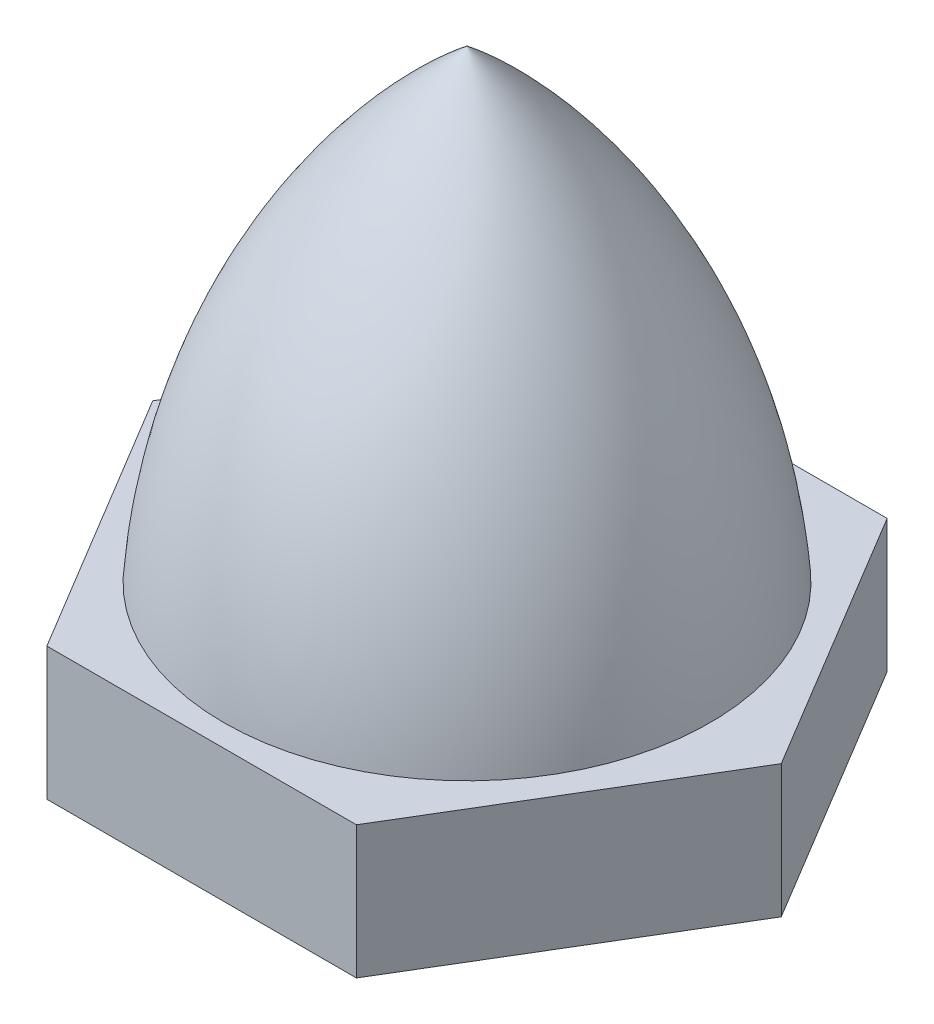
ISO-10303-21;
HEADER;
FILE_DESCRIPTION(('STEP AP214'),'2;1');
FILE_NAME('part.step','',(''),(''),'','','');
FILE_SCHEMA(('AUTOMOTIVE_DESIGN { 1 0 10303 214 1 1 1 1 }'));
ENDSEC;
DATA;
#1=APPLICATION_CONTEXT('core data for automotive mechanical design processes');
#2=APPLICATION_PROTOCOL_DEFINITION('international standard','automotive_design',2000,#1);
#3=PRODUCT_CONTEXT('',#1,'mechanical');
#4=PRODUCT('Part','Part','',(#3));
#5=PRODUCT_RELATED_PRODUCT_CATEGORY('part','',(#4));
#6=PRODUCT_DEFINITION_FORMATION('','',#4);
#7=PRODUCT_DEFINITION_CONTEXT('part definition',#1,'design');
#8=PRODUCT_DEFINITION('design','',#6,#7);
#9=PRODUCT_DEFINITION_SHAPE('','',#8);
#10=(LENGTH_UNIT() NAMED_UNIT(*) SI_UNIT(.MILLI.,.METRE.));
#11=(NAMED_UNIT(*) PLANE_ANGLE_UNIT() SI_UNIT($,.RADIAN.));
#12=(NAMED_UNIT(*) SI_UNIT($,.STERADIAN.) SOLID_ANGLE_UNIT());
#13=UNCERTAINTY_MEASURE_WITH_UNIT(LENGTH_MEASURE(1.E-05),#10,'distance_accuracy_value','');
#14=(GEOMETRIC_REPRESENTATION_CONTEXT(3) GLOBAL_UNCERTAINTY_ASSIGNED_CONTEXT((#13)) GLOBAL_UNIT_ASSIGNED_CONTEXT((#10,
#11,#12)) REPRESENTATION_CONTEXT('',''));
#15=CARTESIAN_POINT('',(0.,0.,0.));
#16=DIRECTION('',(0.,0.,1.));
#17=DIRECTION('',(1.,0.,0.));
#18=AXIS2_PLACEMENT_3D('',#15,#16,#17);
#19=CARTESIAN_POINT('',(-7.10555127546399,0.,0.));
#20=DIRECTION('',(0.,-1.,0.));
#21=DIRECTION('',(0.,0.,-1.));
#22=AXIS2_PLACEMENT_3D('',#19,#20,#21);
#23=PLANE('',#22);
#24=DIRECTION('',(-0.515078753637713,0.,-0.857142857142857));
#25=VECTOR('',#24,1.);
#26=CARTESIAN_POINT('',(-3.5,0.,6.));
#27=LINE('',#26,#25);
#28=CARTESIAN_POINT('',(-3.5,0.,6.));
#29=VERTEX_POINT('',#28);
#30=CARTESIAN_POINT('',(-7.10555127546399,0.,0.));
#31=VERTEX_POINT('',#30);
#32=EDGE_CURVE('E121',#29,#31,#27,.T.);
#33=ORIENTED_EDGE('',*,*,#32,.F.);
#34=DIRECTION('',(-1.,0.,0.));
#35=VECTOR('',#34,1.);
#36=CARTESIAN_POINT('',(-3.5,0.,6.));
#37=LINE('',#36,#35);
#38=CARTESIAN_POINT('',(3.5,0.,6.));
#39=VERTEX_POINT('',#38);
#40=EDGE_CURVE('E77',#39,#29,#37,.T.);
#41=ORIENTED_EDGE('',*,*,#40,.F.);
#42=DIRECTION('',(-0.515078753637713,0.,0.857142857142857));
#43=VECTOR('',#42,1.);
#44=CARTESIAN_POINT('',(3.5,0.,6.));
#45=LINE('',#44,#43);
#46=CARTESIAN_POINT('',(7.10555127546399,0.,0.));
#47=VERTEX_POINT('',#46);
#48=EDGE_CURVE('E130',#47,#39,#45,.T.);
#49=ORIENTED_EDGE('',*,*,#48,.F.);
#50=DIRECTION('',(0.515078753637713,0.,0.857142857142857));
#51=VECTOR('',#50,1.);
#52=CARTESIAN_POINT('',(3.5,0.,-6.));
#53=LINE('',#52,#51);
#54=CARTESIAN_POINT('',(3.5,0.,-6.));
#55=VERTEX_POINT('',#54);
#56=EDGE_CURVE('E109',#55,#47,#53,.T.);
#57=ORIENTED_EDGE('',*,*,#56,.F.);
#58=DIRECTION('',(1.,0.,0.));
#59=VECTOR('',#58,1.);
#60=CARTESIAN_POINT('',(-3.5,0.,-6.));
#61=LINE('',#60,#59);
#62=CARTESIAN_POINT('',(-3.5,0.,-6.));
#63=VERTEX_POINT('',#62);
#64=EDGE_CURVE('E127',#63,#55,#61,.T.);
#65=ORIENTED_EDGE('',*,*,#64,.F.);
#66=DIRECTION('',(0.515078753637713,0.,-0.857142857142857));
#67=VECTOR('',#66,1.);
#68=CARTESIAN_POINT('',(-7.10555127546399,0.,0.));
#69=LINE('',#68,#67);
#70=EDGE_CURVE('E124',#31,#63,#69,.T.);
#71=ORIENTED_EDGE('',*,*,#70,.F.);
#72=EDGE_LOOP('',(#33,#41,#49,#57,#65,#71));
#73=FACE_BOUND('',#72,.T.);
#74=CARTESIAN_POINT('',(0.,0.,0.));
#75=DIRECTION('',(0.,-1.,0.));
#76=DIRECTION('',(0.,0.,-1.));
#77=AXIS2_PLACEMENT_3D('',#74,#75,#76);
#78=CIRCLE('',#77,5.5);
#79=CARTESIAN_POINT('',(0.,0.,-5.5));
#80=VERTEX_POINT('',#79);
#81=EDGE_CURVE('E11',#80,#80,#78,.T.);
#82=ORIENTED_EDGE('',*,*,#81,.T.);
#83=EDGE_LOOP('',(#82));
#84=FACE_BOUND('',#83,.T.);
#85=ADVANCED_FACE('F32',(#73,#84),#23,.F.);
#86=CARTESIAN_POINT('',(-3.5,-3.,6.));
#87=DIRECTION('',(0.857142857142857,0.,-0.515078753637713));
#88=DIRECTION('',(-0.515078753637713,0.,-0.857142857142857));
#89=AXIS2_PLACEMENT_3D('',#86,#87,#88);
#90=PLANE('',#89);
#91=ORIENTED_EDGE('',*,*,#32,.T.);
#92=DIRECTION('',(0.,1.,0.));
#93=VECTOR('',#92,1.);
#94=CARTESIAN_POINT('',(-7.10555127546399,-3.,0.));
#95=LINE('',#94,#93);
#96=CARTESIAN_POINT('',(-7.10555127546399,-3.,0.));
#97=VERTEX_POINT('',#96);
#98=EDGE_CURVE('E40',#97,#31,#95,.T.);
#99=ORIENTED_EDGE('',*,*,#98,.F.);
#100=DIRECTION('',(-0.515078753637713,0.,-0.857142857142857));
#101=VECTOR('',#100,1.);
#102=CARTESIAN_POINT('',(-3.5,-3.,6.));
#103=LINE('',#102,#101);
#104=CARTESIAN_POINT('',(-3.5,-3.,6.));
#105=VERTEX_POINT('',#104);
#106=EDGE_CURVE('E133',#105,#97,#103,.T.);
#107=ORIENTED_EDGE('',*,*,#106,.F.);
#108=DIRECTION('',(0.,1.,0.));
#109=VECTOR('',#108,1.);
#110=CARTESIAN_POINT('',(-3.5,-3.,6.));
#111=LINE('',#110,#109);
#112=EDGE_CURVE('E117',#105,#29,#111,.T.);
#113=ORIENTED_EDGE('',*,*,#112,.T.);
#114=EDGE_LOOP('',(#91,#99,#107,#113));
#115=FACE_BOUND('',#114,.T.);
#116=ADVANCED_FACE('F144',(#115),#90,.F.);
#117=CARTESIAN_POINT('',(-7.10555127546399,-3.,0.));
#118=DIRECTION('',(0.857142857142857,0.,0.515078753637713));
#119=DIRECTION('',(0.515078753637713,0.,-0.857142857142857));
#120=AXIS2_PLACEMENT_3D('',#117,#118,#119);
#121=PLANE('',#120);
#122=ORIENTED_EDGE('',*,*,#70,.T.);
#123=DIRECTION('',(0.,1.,0.));
#124=VECTOR('',#123,1.);
#125=CARTESIAN_POINT('',(-3.5,-3.,-6.));
#126=LINE('',#125,#124);
#127=CARTESIAN_POINT('',(-3.5,-3.,-6.));
#128=VERTEX_POINT('',#127);
#129=EDGE_CURVE('E137',#128,#63,#126,.T.);
#130=ORIENTED_EDGE('',*,*,#129,.F.);
#131=DIRECTION('',(0.515078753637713,0.,-0.857142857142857));
#132=VECTOR('',#131,1.);
#133=CARTESIAN_POINT('',(-7.10555127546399,-3.,0.));
#134=LINE('',#133,#132);
#135=EDGE_CURVE('E86',#97,#128,#134,.T.);
#136=ORIENTED_EDGE('',*,*,#135,.F.);
#137=ORIENTED_EDGE('',*,*,#98,.T.);
#138=EDGE_LOOP('',(#122,#130,#136,#137));
#139=FACE_BOUND('',#138,.T.);
#140=ADVANCED_FACE('F140',(#139),#121,.F.);
#141=CARTESIAN_POINT('',(-3.5,-3.,-6.));
#142=DIRECTION('',(0.,0.,1.));
#143=DIRECTION('',(1.,0.,0.));
#144=AXIS2_PLACEMENT_3D('',#141,#142,#143);
#145=PLANE('',#144);
#146=ORIENTED_EDGE('',*,*,#64,.T.);
#147=DIRECTION('',(0.,1.,0.));
#148=VECTOR('',#147,1.);
#149=CARTESIAN_POINT('',(3.5,-3.,-6.));
#150=LINE('',#149,#148);
#151=CARTESIAN_POINT('',(3.5,-3.,-6.));
#152=VERTEX_POINT('',#151);
#153=EDGE_CURVE('E112',#152,#55,#150,.T.);
#154=ORIENTED_EDGE('',*,*,#153,.F.);
#155=DIRECTION('',(1.,0.,0.));
#156=VECTOR('',#155,1.);
#157=CARTESIAN_POINT('',(-3.5,-3.,-6.));
#158=LINE('',#157,#156);
#159=EDGE_CURVE('E100',#128,#152,#158,.T.);
#160=ORIENTED_EDGE('',*,*,#159,.F.);
#161=ORIENTED_EDGE('',*,*,#129,.T.);
#162=EDGE_LOOP('',(#146,#154,#160,#161));
#163=FACE_BOUND('',#162,.T.);
#164=ADVANCED_FACE('F149',(#163),#145,.F.);
#165=CARTESIAN_POINT('',(3.5,-3.,-6.));
#166=DIRECTION('',(-0.857142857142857,0.,0.515078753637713));
#167=DIRECTION('',(0.515078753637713,0.,0.857142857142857));
#168=AXIS2_PLACEMENT_3D('',#165,#166,#167);
#169=PLANE('',#168);
#170=ORIENTED_EDGE('',*,*,#56,.T.);
#171=DIRECTION('',(0.,1.,0.));
#172=VECTOR('',#171,1.);
#173=CARTESIAN_POINT('',(7.10555127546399,-3.,0.));
#174=LINE('',#173,#172);
#175=CARTESIAN_POINT('',(7.10555127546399,-3.,0.));
#176=VERTEX_POINT('',#175);
#177=EDGE_CURVE('E106',#176,#47,#174,.T.);
#178=ORIENTED_EDGE('',*,*,#177,.F.);
#179=DIRECTION('',(0.515078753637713,0.,0.857142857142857));
#180=VECTOR('',#179,1.);
#181=CARTESIAN_POINT('',(3.5,-3.,-6.));
#182=LINE('',#181,#180);
#183=EDGE_CURVE('E93',#152,#176,#182,.T.);
#184=ORIENTED_EDGE('',*,*,#183,.F.);
#185=ORIENTED_EDGE('',*,*,#153,.T.);
#186=EDGE_LOOP('',(#170,#178,#184,#185));
#187=FACE_BOUND('',#186,.T.);
#188=ADVANCED_FACE('F107',(#187),#169,.F.);
#189=CARTESIAN_POINT('',(3.5,-3.,6.));
#190=DIRECTION('',(-0.857142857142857,0.,-0.515078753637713));
#191=DIRECTION('',(-0.515078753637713,0.,0.857142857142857));
#192=AXIS2_PLACEMENT_3D('',#189,#190,#191);
#193=PLANE('',#192);
#194=ORIENTED_EDGE('',*,*,#48,.T.);
#195=DIRECTION('',(0.,1.,0.));
#196=VECTOR('',#195,1.);
#197=CARTESIAN_POINT('',(3.5,-3.,6.));
#198=LINE('',#197,#196);
#199=CARTESIAN_POINT('',(3.5,-3.,6.));
#200=VERTEX_POINT('',#199);
#201=EDGE_CURVE('E113',#200,#39,#198,.T.);
#202=ORIENTED_EDGE('',*,*,#201,.F.);
#203=DIRECTION('',(-0.515078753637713,0.,0.857142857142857));
#204=VECTOR('',#203,1.);
#205=CARTESIAN_POINT('',(3.5,-3.,6.));
#206=LINE('',#205,#204);
#207=EDGE_CURVE('E97',#176,#200,#206,.T.);
#208=ORIENTED_EDGE('',*,*,#207,.F.);
#209=ORIENTED_EDGE('',*,*,#177,.T.);
#210=EDGE_LOOP('',(#194,#202,#208,#209));
#211=FACE_BOUND('',#210,.T.);
#212=ADVANCED_FACE('F115',(#211),#193,.F.);
#213=CARTESIAN_POINT('',(-3.5,-3.,6.));
#214=DIRECTION('',(0.,0.,-1.));
#215=DIRECTION('',(-1.,0.,0.));
#216=AXIS2_PLACEMENT_3D('',#213,#214,#215);
#217=PLANE('',#216);
#218=ORIENTED_EDGE('',*,*,#40,.T.);
#219=ORIENTED_EDGE('',*,*,#112,.F.);
#220=DIRECTION('',(-1.,0.,0.));
#221=VECTOR('',#220,1.);
#222=CARTESIAN_POINT('',(-3.5,-3.,6.));
#223=LINE('',#222,#221);
#224=EDGE_CURVE('E51',#200,#105,#223,.T.);
#225=ORIENTED_EDGE('',*,*,#224,.F.);
#226=ORIENTED_EDGE('',*,*,#201,.T.);
#227=EDGE_LOOP('',(#218,#219,#225,#226));
#228=FACE_BOUND('',#227,.T.);
#229=ADVANCED_FACE('F168',(#228),#217,.F.);
#230=CARTESIAN_POINT('',(-7.10555127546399,-3.,0.));
#231=DIRECTION('',(0.,-1.,0.));
#232=DIRECTION('',(0.,0.,-1.));
#233=AXIS2_PLACEMENT_3D('',#230,#231,#232);
#234=PLANE('',#233);
#235=CARTESIAN_POINT('',(0.,-3.,0.));
#236=DIRECTION('',(0.,-1.,0.));
#237=DIRECTION('',(0.,0.,-1.));
#238=AXIS2_PLACEMENT_3D('',#235,#236,#237);
#239=CIRCLE('',#238,2.5);
#240=CARTESIAN_POINT('',(0.,-3.,-2.5));
#241=VERTEX_POINT('',#240);
#242=EDGE_CURVE('E153',#241,#241,#239,.T.);
#243=ORIENTED_EDGE('',*,*,#242,.F.);
#244=EDGE_LOOP('',(#243));
#245=FACE_BOUND('',#244,.T.);
#246=ORIENTED_EDGE('',*,*,#106,.T.);
#247=ORIENTED_EDGE('',*,*,#135,.T.);
#248=ORIENTED_EDGE('',*,*,#159,.T.);
#249=ORIENTED_EDGE('',*,*,#183,.T.);
#250=ORIENTED_EDGE('',*,*,#207,.T.);
#251=ORIENTED_EDGE('',*,*,#224,.T.);
#252=EDGE_LOOP('',(#246,#247,#248,#249,#250,#251));
#253=FACE_BOUND('',#252,.T.);
#254=ADVANCED_FACE('F95',(#245,#253),#234,.T.);
#255=CARTESIAN_POINT('',(0.,-1.14379077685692,-9.45632784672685));
#256=DIRECTION('',(-1.,0.,0.));
#257=DIRECTION('',(0.,0.,1.));
#258=AXIS2_PLACEMENT_3D('',#255,#256,#257);
#259=CIRCLE('',#258,15.);
#260=TRIMMED_CURVE('',#259,(PARAMETER_VALUE(-0.888699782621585)),
(PARAMETER_VALUE(0.888699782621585)),.T.,.PARAMETER.);
#261=CARTESIAN_POINT('',(0.,-1.14379077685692,0.));
#262=DIRECTION('',(0.,1.,0.));
#263=AXIS1_PLACEMENT('',#261,#262);
#264=SURFACE_OF_REVOLUTION('',#260,#263);
#265=CARTESIAN_POINT('',(0.,10.5,0.));
#266=VERTEX_POINT('',#265);
#267=VERTEX_LOOP('',#266);
#268=FACE_BOUND('',#267,.T.);
#269=ORIENTED_EDGE('',*,*,#81,.F.);
#270=EDGE_LOOP('',(#269));
#271=FACE_BOUND('',#270,.T.);
#272=ADVANCED_FACE('F34',(#268,#271),#264,.T.);
#273=CARTESIAN_POINT('',(0.,7.5,0.));
#274=DIRECTION('',(0.,-1.,0.));
#275=DIRECTION('',(0.,0.,-1.));
#276=AXIS2_PLACEMENT_3D('',#273,#274,#275);
#277=CYLINDRICAL_SURFACE('',#276,2.5);
#278=CARTESIAN_POINT('',(0.,7.5,0.));
#279=DIRECTION('',(0.,-1.,0.));
#280=DIRECTION('',(0.,0.,-1.));
#281=AXIS2_PLACEMENT_3D('',#278,#279,#280);
#282=CIRCLE('',#281,2.5);
#283=CARTESIAN_POINT('',(0.,7.5,-2.5));
#284=VERTEX_POINT('',#283);
#285=EDGE_CURVE('E125',#284,#284,#282,.T.);
#286=CARTESIAN_POINT('',(0.,7.5,-2.5));
#287=CARTESIAN_POINT('',(0.,7.390625,-2.5));
#288=CARTESIAN_POINT('',(0.,7.28125,-2.5));
#289=CARTESIAN_POINT('',(0.,7.0625,-2.5));
#290=CARTESIAN_POINT('',(0.,6.953125,-2.5));
#291=CARTESIAN_POINT('',(0.,6.734375,-2.5));
#292=CARTESIAN_POINT('',(0.,6.625,-2.5));
#293=CARTESIAN_POINT('',(0.,6.40625,-2.5));
#294=CARTESIAN_POINT('',(0.,6.296875,-2.5));
#295=CARTESIAN_POINT('',(0.,6.078125,-2.5));
#296=CARTESIAN_POINT('',(0.,5.96875,-2.5));
#297=CARTESIAN_POINT('',(0.,5.75,-2.5));
#298=CARTESIAN_POINT('',(0.,5.640625,-2.5));
#299=CARTESIAN_POINT('',(0.,5.421875,-2.5));
#300=CARTESIAN_POINT('',(0.,5.3125,-2.5));
#301=CARTESIAN_POINT('',(0.,5.09375,-2.5));
#302=CARTESIAN_POINT('',(0.,4.984375,-2.5));
#303=CARTESIAN_POINT('',(0.,4.765625,-2.5));
#304=CARTESIAN_POINT('',(0.,4.65625,-2.5));
#305=CARTESIAN_POINT('',(0.,4.4375,-2.5));
#306=CARTESIAN_POINT('',(0.,4.328125,-2.5));
#307=CARTESIAN_POINT('',(0.,4.109375,-2.5));
#308=CARTESIAN_POINT('',(0.,4.,-2.5));
#309=CARTESIAN_POINT('',(0.,3.78125,-2.5));
#310=CARTESIAN_POINT('',(0.,3.671875,-2.5));
#311=CARTESIAN_POINT('',(0.,3.453125,-2.5));
#312=CARTESIAN_POINT('',(0.,3.34375,-2.5));
#313=CARTESIAN_POINT('',(0.,3.125,-2.5));
#314=CARTESIAN_POINT('',(0.,3.015625,-2.5));
#315=CARTESIAN_POINT('',(0.,2.796875,-2.5));
#316=CARTESIAN_POINT('',(0.,2.6875,-2.5));
#317=CARTESIAN_POINT('',(0.,2.46875,-2.5));
#318=CARTESIAN_POINT('',(0.,2.359375,-2.5));
#319=CARTESIAN_POINT('',(0.,2.140625,-2.5));
#320=CARTESIAN_POINT('',(0.,2.03125,-2.5));
#321=CARTESIAN_POINT('',(0.,1.8125,-2.5));
#322=CARTESIAN_POINT('',(0.,1.703125,-2.5));
#323=CARTESIAN_POINT('',(0.,1.484375,-2.5));
#324=CARTESIAN_POINT('',(0.,1.375,-2.5));
#325=CARTESIAN_POINT('',(0.,1.15625,-2.5));
#326=CARTESIAN_POINT('',(0.,1.046875,-2.5));
#327=CARTESIAN_POINT('',(0.,0.828125,-2.5));
#328=CARTESIAN_POINT('',(0.,0.71875,-2.5));
#329=CARTESIAN_POINT('',(0.,0.5,-2.5));
#330=CARTESIAN_POINT('',(0.,0.390625,-2.5));
#331=CARTESIAN_POINT('',(0.,0.171875,-2.5));
#332=CARTESIAN_POINT('',(0.,0.0625000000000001,-2.5));
#333=CARTESIAN_POINT('',(0.,-0.15625,-2.5));
#334=CARTESIAN_POINT('',(0.,-0.265625,-2.5));
#335=CARTESIAN_POINT('',(0.,-0.484375,-2.5));
#336=CARTESIAN_POINT('',(0.,-0.59375,-2.5));
#337=CARTESIAN_POINT('',(0.,-0.8125,-2.5));
#338=CARTESIAN_POINT('',(0.,-0.921875,-2.5));
#339=CARTESIAN_POINT('',(0.,-1.140625,-2.5));
#340=CARTESIAN_POINT('',(0.,-1.25,-2.5));
#341=CARTESIAN_POINT('',(0.,-1.46875,-2.5));
#342=CARTESIAN_POINT('',(0.,-1.578125,-2.5));
#343=CARTESIAN_POINT('',(0.,-1.796875,-2.5));
#344=CARTESIAN_POINT('',(0.,-1.90625,-2.5));
#345=CARTESIAN_POINT('',(0.,-2.125,-2.5));
#346=CARTESIAN_POINT('',(0.,-2.234375,-2.5));
#347=CARTESIAN_POINT('',(0.,-2.453125,-2.5));
#348=CARTESIAN_POINT('',(0.,-2.5625,-2.5));
#349=CARTESIAN_POINT('',(0.,-2.78125,-2.5));
#350=CARTESIAN_POINT('',(0.,-2.890625,-2.5));
#351=CARTESIAN_POINT('',(0.,-3.,-2.5));
#352=B_SPLINE_CURVE_WITH_KNOTS('',3,(#286,#287,#288,#289,#290,#291,#292,#293,#294,#295,#296,
#297,#298,#299,#300,#301,#302,#303,#304,#305,#306,#307,#308,#309,#310,#311,#312,#313,#314,#315,
#316,#317,#318,#319,#320,#321,#322,#323,#324,#325,#326,#327,#328,#329,#330,#331,#332,#333,#334,
#335,#336,#337,#338,#339,#340,#341,#342,#343,#344,#345,#346,#347,#348,#349,#350,#351),
.UNSPECIFIED.,.F.,.F.,(4,2,2,2,2,2,2,2,2,2,2,2,2,2,2,2,2,2,2,2,2,2,2,2,2,2,2,2,2,2,2,2,4),(0.,
0.328124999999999,0.65625,0.984375,1.3125,1.640625,1.96875,2.296875,2.625,2.953125,3.28125,
3.609375,3.9375,4.265625,4.59375,4.921875,5.25,5.578125,5.90625,6.234375,6.5625,6.890625,
7.21875,7.546875,7.875,8.203125,8.53125,8.859375,9.1875,9.515625,9.84375,10.171875,10.5),.UNSPECIFIED.);
#353=EDGE_CURVE('BSEAM161',#284,#241,#352,.T.);
#354=ORIENTED_EDGE('',*,*,#285,.F.);
#355=ORIENTED_EDGE('',*,*,#242,.T.);
#356=ORIENTED_EDGE('',*,*,#353,.T.);
#357=ORIENTED_EDGE('',*,*,#353,.F.);
#358=EDGE_LOOP('',(#354,#356,#355,#357));
#359=FACE_BOUND('',#358,.T.);
#360=ADVANCED_FACE('F161',(#359),#277,.F.);
#361=CARTESIAN_POINT('',(0.,7.5,0.));
#362=DIRECTION('',(0.,-1.,0.));
#363=DIRECTION('',(0.,0.,-1.));
#364=AXIS2_PLACEMENT_3D('',#361,#362,#363);
#365=PLANE('',#364);
#366=ORIENTED_EDGE('',*,*,#285,.T.);
#367=EDGE_LOOP('',(#366));
#368=FACE_BOUND('',#367,.T.);
#369=ADVANCED_FACE('F159',(#368),#365,.T.);
#370=CLOSED_SHELL('',(#85,#116,#140,#164,#188,#212,#229,#254,#272,#360,#369));
#371=MANIFOLD_SOLID_BREP('B2',#370);
#372=ADVANCED_BREP_SHAPE_REPRESENTATION('',(#18,#371),#14);
#373=SHAPE_DEFINITION_REPRESENTATION(#9,#372);
ENDSEC;
END-ISO-10303-21;
